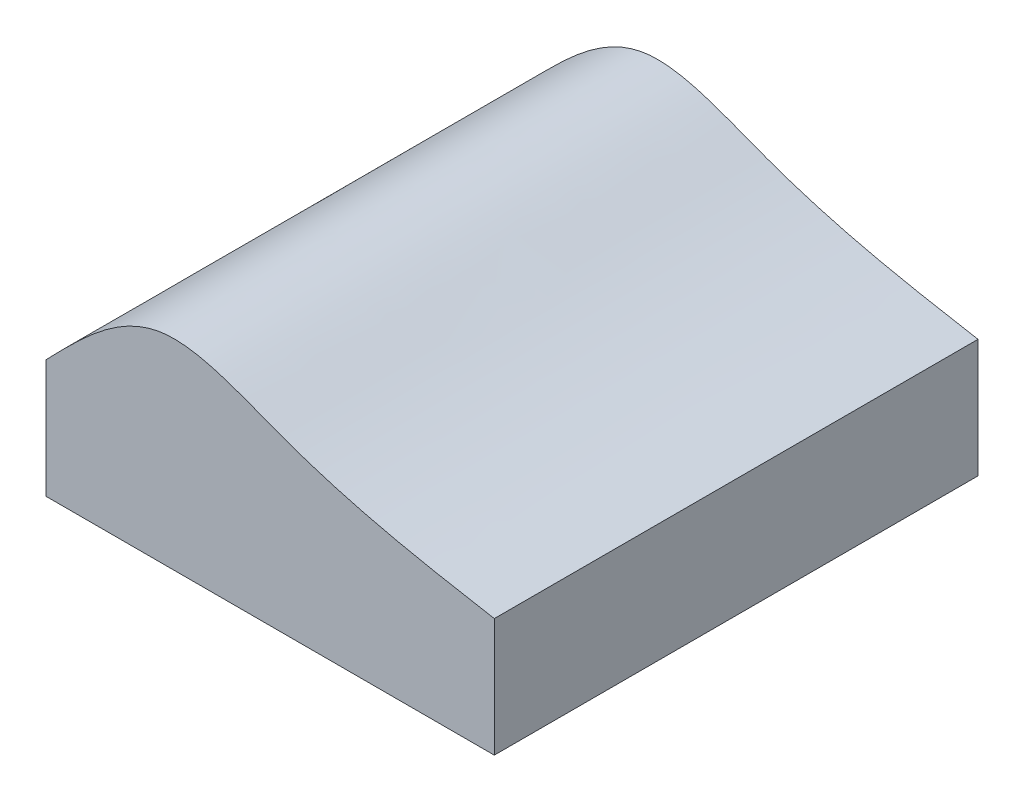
ISO-10303-21;
HEADER;
FILE_DESCRIPTION(('STEP AP214'),'2;1');
FILE_NAME('part.step','',(''),(''),'','','');
FILE_SCHEMA(('AUTOMOTIVE_DESIGN { 1 0 10303 214 1 1 1 1 }'));
ENDSEC;
DATA;
#1=APPLICATION_CONTEXT('core data for automotive mechanical design processes');
#2=APPLICATION_PROTOCOL_DEFINITION('international standard','automotive_design',2000,#1);
#3=PRODUCT_CONTEXT('',#1,'mechanical');
#4=PRODUCT('Part','Part','',(#3));
#5=PRODUCT_RELATED_PRODUCT_CATEGORY('part','',(#4));
#6=PRODUCT_DEFINITION_FORMATION('','',#4);
#7=PRODUCT_DEFINITION_CONTEXT('part definition',#1,'design');
#8=PRODUCT_DEFINITION('design','',#6,#7);
#9=PRODUCT_DEFINITION_SHAPE('','',#8);
#10=(LENGTH_UNIT() NAMED_UNIT(*) SI_UNIT(.MILLI.,.METRE.));
#11=(NAMED_UNIT(*) PLANE_ANGLE_UNIT() SI_UNIT($,.RADIAN.));
#12=(NAMED_UNIT(*) SI_UNIT($,.STERADIAN.) SOLID_ANGLE_UNIT());
#13=UNCERTAINTY_MEASURE_WITH_UNIT(LENGTH_MEASURE(1.E-05),#10,'distance_accuracy_value','');
#14=(GEOMETRIC_REPRESENTATION_CONTEXT(3) GLOBAL_UNCERTAINTY_ASSIGNED_CONTEXT((#13)) GLOBAL_UNIT_ASSIGNED_CONTEXT((#10,
#11,#12)) REPRESENTATION_CONTEXT('',''));
#15=CARTESIAN_POINT('',(0.,0.,0.));
#16=DIRECTION('',(0.,0.,1.));
#17=DIRECTION('',(1.,0.,0.));
#18=AXIS2_PLACEMENT_3D('',#15,#16,#17);
#19=CARTESIAN_POINT('',(0.,0.,45.5));
#20=DIRECTION('',(1.,0.,0.));
#21=DIRECTION('',(0.,0.,-1.));
#22=AXIS2_PLACEMENT_3D('',#19,#20,#21);
#23=PLANE('',#22);
#24=DIRECTION('',(0.,-1.,0.));
#25=VECTOR('',#24,1.);
#26=CARTESIAN_POINT('',(0.,0.,-45.5));
#27=LINE('',#26,#25);
#28=CARTESIAN_POINT('',(0.,22.2547523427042,-45.5));
#29=VERTEX_POINT('',#28);
#30=CARTESIAN_POINT('',(0.,0.,-45.5));
#31=VERTEX_POINT('',#30);
#32=EDGE_CURVE('E98',#29,#31,#27,.T.);
#33=ORIENTED_EDGE('',*,*,#32,.T.);
#34=DIRECTION('',(0.,0.,-1.));
#35=VECTOR('',#34,1.);
#36=CARTESIAN_POINT('',(0.,0.,45.5));
#37=LINE('',#36,#35);
#38=CARTESIAN_POINT('',(0.,0.,45.5));
#39=VERTEX_POINT('',#38);
#40=EDGE_CURVE('E11',#39,#31,#37,.T.);
#41=ORIENTED_EDGE('',*,*,#40,.F.);
#42=DIRECTION('',(0.,-1.,0.));
#43=VECTOR('',#42,1.);
#44=CARTESIAN_POINT('',(0.,0.,45.5));
#45=LINE('',#44,#43);
#46=CARTESIAN_POINT('',(0.,22.2547523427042,45.5));
#47=VERTEX_POINT('',#46);
#48=EDGE_CURVE('E83',#47,#39,#45,.T.);
#49=ORIENTED_EDGE('',*,*,#48,.F.);
#50=DIRECTION('',(0.,0.,-1.));
#51=VECTOR('',#50,1.);
#52=CARTESIAN_POINT('',(0.,22.2547523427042,45.5));
#53=LINE('',#52,#51);
#54=EDGE_CURVE('E91',#47,#29,#53,.T.);
#55=ORIENTED_EDGE('',*,*,#54,.T.);
#56=EDGE_LOOP('',(#33,#41,#49,#55));
#57=FACE_BOUND('',#56,.T.);
#58=ADVANCED_FACE('F32',(#57),#23,.F.);
#59=CARTESIAN_POINT('',(0.,0.,45.5));
#60=DIRECTION('',(0.,1.,0.));
#61=DIRECTION('',(0.,0.,1.));
#62=AXIS2_PLACEMENT_3D('',#59,#60,#61);
#63=PLANE('',#62);
#64=DIRECTION('',(1.,0.,0.));
#65=VECTOR('',#64,1.);
#66=CARTESIAN_POINT('',(0.,0.,-45.5));
#67=LINE('',#66,#65);
#68=CARTESIAN_POINT('',(84.343641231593,0.,-45.5));
#69=VERTEX_POINT('',#68);
#70=EDGE_CURVE('E87',#31,#69,#67,.T.);
#71=ORIENTED_EDGE('',*,*,#70,.T.);
#72=DIRECTION('',(0.,0.,-1.));
#73=VECTOR('',#72,1.);
#74=CARTESIAN_POINT('',(84.343641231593,0.,45.5));
#75=LINE('',#74,#73);
#76=CARTESIAN_POINT('',(84.343641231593,0.,45.5));
#77=VERTEX_POINT('',#76);
#78=EDGE_CURVE('E40',#77,#69,#75,.T.);
#79=ORIENTED_EDGE('',*,*,#78,.F.);
#80=DIRECTION('',(1.,0.,0.));
#81=VECTOR('',#80,1.);
#82=CARTESIAN_POINT('',(0.,0.,45.5));
#83=LINE('',#82,#81);
#84=EDGE_CURVE('E78',#39,#77,#83,.T.);
#85=ORIENTED_EDGE('',*,*,#84,.F.);
#86=ORIENTED_EDGE('',*,*,#40,.T.);
#87=EDGE_LOOP('',(#71,#79,#85,#86));
#88=FACE_BOUND('',#87,.T.);
#89=ADVANCED_FACE('F86',(#88),#63,.F.);
#90=CARTESIAN_POINT('',(84.343641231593,0.,45.5));
#91=DIRECTION('',(-1.,0.,0.));
#92=DIRECTION('',(0.,0.,1.));
#93=AXIS2_PLACEMENT_3D('',#90,#91,#92);
#94=PLANE('',#93);
#95=DIRECTION('',(0.,1.,0.));
#96=VECTOR('',#95,1.);
#97=CARTESIAN_POINT('',(84.343641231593,0.,-45.5));
#98=LINE('',#97,#96);
#99=CARTESIAN_POINT('',(84.343641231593,22.2547523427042,-45.5));
#100=VERTEX_POINT('',#99);
#101=EDGE_CURVE('E65',#69,#100,#98,.T.);
#102=ORIENTED_EDGE('',*,*,#101,.T.);
#103=DIRECTION('',(0.,0.,-1.));
#104=VECTOR('',#103,1.);
#105=CARTESIAN_POINT('',(84.343641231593,22.2547523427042,45.5));
#106=LINE('',#105,#104);
#107=CARTESIAN_POINT('',(84.343641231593,22.2547523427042,45.5));
#108=VERTEX_POINT('',#107);
#109=EDGE_CURVE('E88',#108,#100,#106,.T.);
#110=ORIENTED_EDGE('',*,*,#109,.F.);
#111=DIRECTION('',(0.,1.,0.));
#112=VECTOR('',#111,1.);
#113=CARTESIAN_POINT('',(84.343641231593,0.,45.5));
#114=LINE('',#113,#112);
#115=EDGE_CURVE('E81',#77,#108,#114,.T.);
#116=ORIENTED_EDGE('',*,*,#115,.F.);
#117=ORIENTED_EDGE('',*,*,#78,.T.);
#118=EDGE_LOOP('',(#102,#110,#116,#117));
#119=FACE_BOUND('',#118,.T.);
#120=ADVANCED_FACE('F89',(#119),#94,.F.);
#121=CARTESIAN_POINT('',(84.343641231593,22.2547523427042,45.5));
#122=CARTESIAN_POINT('',(71.156953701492,24.5980222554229,45.5));
#123=CARTESIAN_POINT('',(50.563808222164,28.2574172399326,45.5));
#124=CARTESIAN_POINT('',(19.8240524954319,42.7398195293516,45.5));
#125=CARTESIAN_POINT('',(6.9175801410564,29.4029927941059,45.5));
#126=CARTESIAN_POINT('',(0.,22.2547523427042,45.5));
#127=B_SPLINE_CURVE_WITH_KNOTS('',3,(#121,#122,#123,#124,#125,#126),.UNSPECIFIED.,.F.,.F.,(4,1,
1,4),(0.,0.452402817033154,0.706500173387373,1.),.UNSPECIFIED.);
#128=DIRECTION('',(0.,0.,-1.));
#129=VECTOR('',#128,1.);
#130=SURFACE_OF_LINEAR_EXTRUSION('',#127,#129);
#131=CARTESIAN_POINT('',(84.343641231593,22.2547523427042,-45.5));
#132=CARTESIAN_POINT('',(71.156953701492,24.5980222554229,-45.5));
#133=CARTESIAN_POINT('',(50.563808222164,28.2574172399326,-45.5));
#134=CARTESIAN_POINT('',(19.8240524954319,42.7398195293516,-45.5));
#135=CARTESIAN_POINT('',(6.9175801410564,29.4029927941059,-45.5));
#136=CARTESIAN_POINT('',(0.,22.2547523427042,-45.5));
#137=B_SPLINE_CURVE_WITH_KNOTS('',3,(#131,#132,#133,#134,#135,#136),.UNSPECIFIED.,.F.,.F.,(4,1,
1,4),(0.,0.452402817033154,0.706500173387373,1.),.UNSPECIFIED.);
#138=EDGE_CURVE('E71',#100,#29,#137,.T.);
#139=ORIENTED_EDGE('',*,*,#138,.T.);
#140=ORIENTED_EDGE('',*,*,#54,.F.);
#141=EDGE_CURVE('E48',#108,#47,#127,.T.);
#142=ORIENTED_EDGE('',*,*,#141,.F.);
#143=ORIENTED_EDGE('',*,*,#109,.T.);
#144=EDGE_LOOP('',(#139,#140,#142,#143));
#145=FACE_BOUND('',#144,.T.);
#146=ADVANCED_FACE('F104',(#145),#130,.F.);
#147=CARTESIAN_POINT('',(40.0060543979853,33.6235358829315,45.5));
#148=DIRECTION('',(0.,0.,1.));
#149=DIRECTION('',(1.,0.,0.));
#150=AXIS2_PLACEMENT_3D('',#147,#148,#149);
#151=PLANE('',#150);
#152=ORIENTED_EDGE('',*,*,#48,.T.);
#153=ORIENTED_EDGE('',*,*,#84,.T.);
#154=ORIENTED_EDGE('',*,*,#115,.T.);
#155=ORIENTED_EDGE('',*,*,#141,.T.);
#156=EDGE_LOOP('',(#152,#153,#154,#155));
#157=FACE_BOUND('',#156,.T.);
#158=ADVANCED_FACE('F79',(#157),#151,.T.);
#159=CARTESIAN_POINT('',(40.0060543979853,33.6235358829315,-45.5));
#160=DIRECTION('',(0.,0.,1.));
#161=DIRECTION('',(1.,0.,0.));
#162=AXIS2_PLACEMENT_3D('',#159,#160,#161);
#163=PLANE('',#162);
#164=ORIENTED_EDGE('',*,*,#32,.F.);
#165=ORIENTED_EDGE('',*,*,#138,.F.);
#166=ORIENTED_EDGE('',*,*,#101,.F.);
#167=ORIENTED_EDGE('',*,*,#70,.F.);
#168=EDGE_LOOP('',(#164,#165,#166,#167));
#169=FACE_BOUND('',#168,.T.);
#170=ADVANCED_FACE('F108',(#169),#163,.F.);
#171=CLOSED_SHELL('',(#58,#89,#120,#146,#158,#170));
#172=MANIFOLD_SOLID_BREP('B2',#171);
#173=ADVANCED_BREP_SHAPE_REPRESENTATION('',(#18,#172),#14);
#174=SHAPE_DEFINITION_REPRESENTATION(#9,#173);
ENDSEC;
END-ISO-10303-21;
